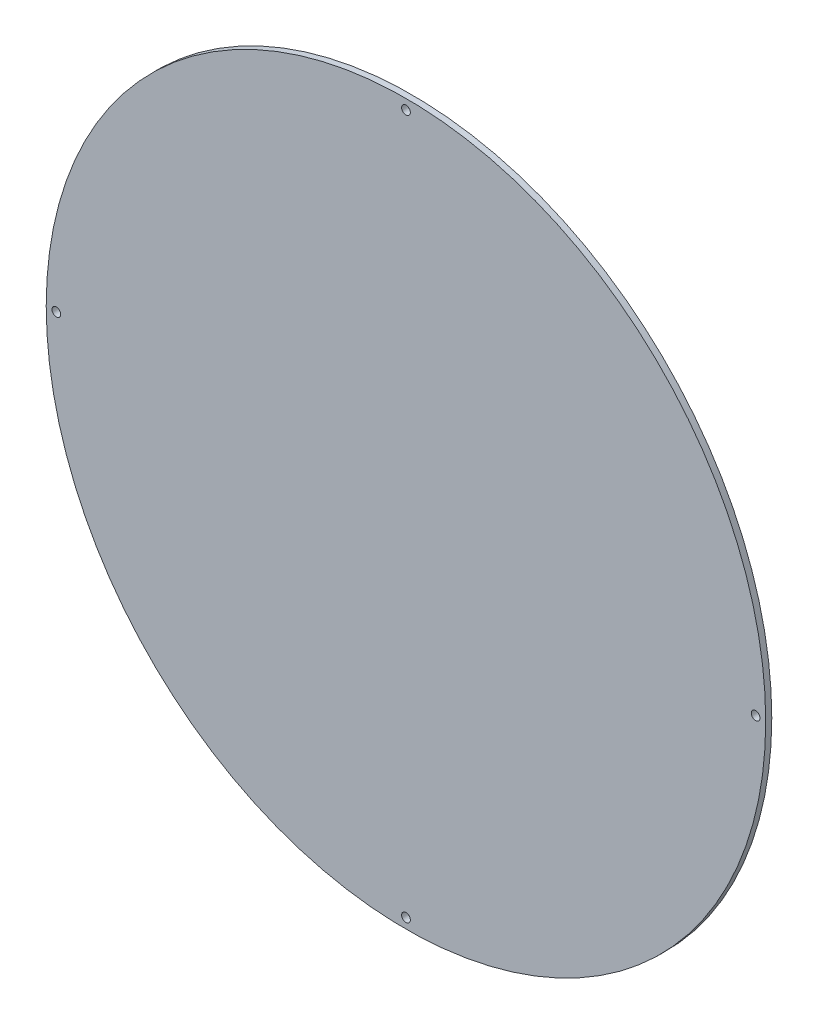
from build123d import *

# Parameters (mm, degrees)
SKETCH1_R           = 177.8
BOSS_EXTRUDE1_DEPTH = 3
CIRPATTERN2_COUNT   = 4


with BuildPart() as part:
    # Sketch1 → Boss-Extrude1 (new body)
    with BuildSketch(Plane.XY):
        Circle(SKETCH1_R)
    extrude(amount=BOSS_EXTRUDE1_DEPTH)

    # Sketch14 → M4 Clearance Hole1 (revolve, cut)
    with BuildSketch(Plane(origin=(172.8, 0, 3), x_dir=(0, -1, 0), z_dir=(1, 0, 0))):
        Polygon((0, 0), (0, 26.691850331), (2.15, 25.4), (2.15, 0), align=None)
    m4_clearance_hole1 = revolve(axis=Axis((172.8, 0, 9.35), (0, 0, -1)), mode=Mode.SUBTRACT)

    # CirPattern2: M4 Clearance Hole1 ×4 about axis
    cirpattern2_axis = Axis((0, 0, 0), (0, 0, 1))
    for i in range(1, CIRPATTERN2_COUNT):
        add(m4_clearance_hole1.rotate(cirpattern2_axis, i * 360 / CIRPATTERN2_COUNT), mode=Mode.SUBTRACT)


solid = part.part
